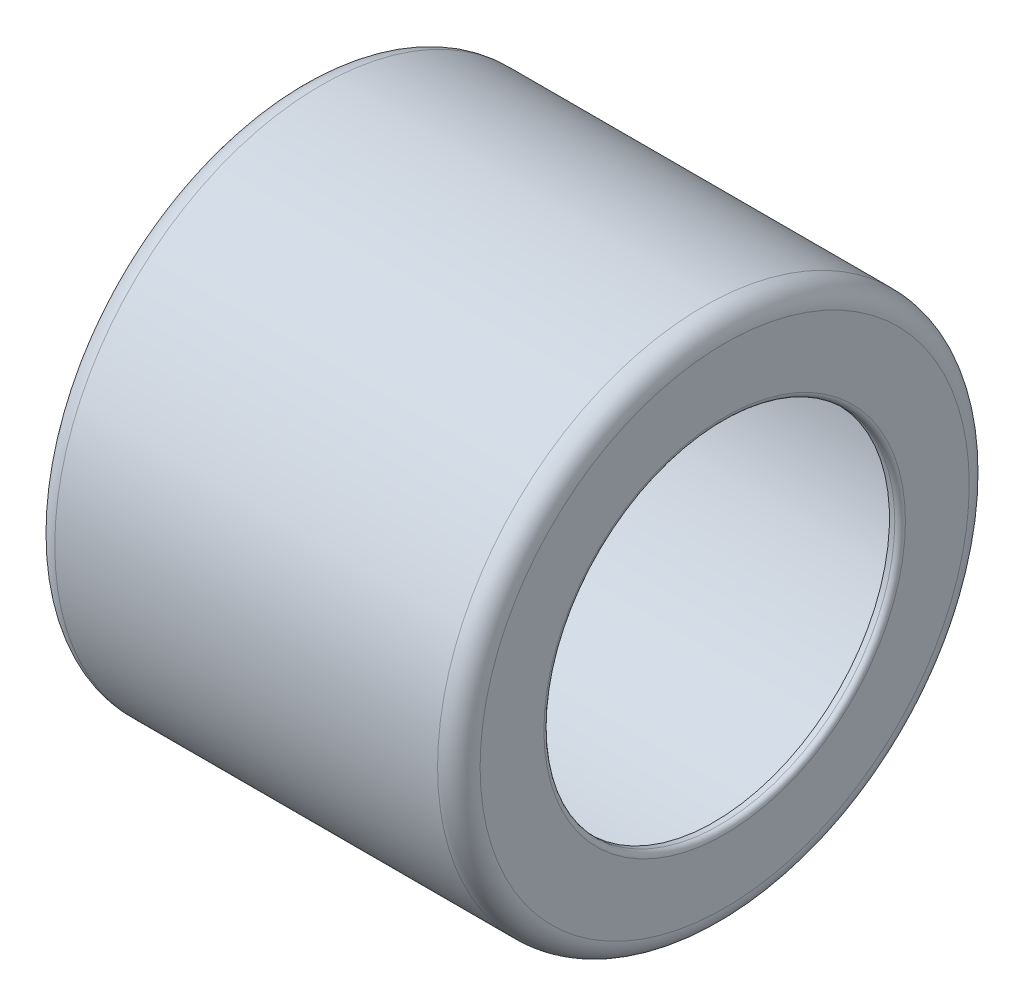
ISO-10303-21;
HEADER;
FILE_DESCRIPTION(('STEP AP214'),'2;1');
FILE_NAME('part.step','',(''),(''),'','','');
FILE_SCHEMA(('AUTOMOTIVE_DESIGN { 1 0 10303 214 1 1 1 1 }'));
ENDSEC;
DATA;
#1=APPLICATION_CONTEXT('core data for automotive mechanical design processes');
#2=APPLICATION_PROTOCOL_DEFINITION('international standard','automotive_design',2000,#1);
#3=PRODUCT_CONTEXT('',#1,'mechanical');
#4=PRODUCT('Part','Part','',(#3));
#5=PRODUCT_RELATED_PRODUCT_CATEGORY('part','',(#4));
#6=PRODUCT_DEFINITION_FORMATION('','',#4);
#7=PRODUCT_DEFINITION_CONTEXT('part definition',#1,'design');
#8=PRODUCT_DEFINITION('design','',#6,#7);
#9=PRODUCT_DEFINITION_SHAPE('','',#8);
#10=(LENGTH_UNIT() NAMED_UNIT(*) SI_UNIT(.MILLI.,.METRE.));
#11=(NAMED_UNIT(*) PLANE_ANGLE_UNIT() SI_UNIT($,.RADIAN.));
#12=(NAMED_UNIT(*) SI_UNIT($,.STERADIAN.) SOLID_ANGLE_UNIT());
#13=UNCERTAINTY_MEASURE_WITH_UNIT(LENGTH_MEASURE(1.E-05),#10,'distance_accuracy_value','');
#14=(GEOMETRIC_REPRESENTATION_CONTEXT(3) GLOBAL_UNCERTAINTY_ASSIGNED_CONTEXT((#13)) GLOBAL_UNIT_ASSIGNED_CONTEXT((#10,
#11,#12)) REPRESENTATION_CONTEXT('',''));
#15=CARTESIAN_POINT('',(0.,0.,0.));
#16=DIRECTION('',(0.,0.,1.));
#17=DIRECTION('',(1.,0.,0.));
#18=AXIS2_PLACEMENT_3D('',#15,#16,#17);
#19=CARTESIAN_POINT('',(3.80000000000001,5.,0.));
#20=DIRECTION('',(1.,0.,0.));
#21=DIRECTION('',(0.,0.,-1.));
#22=AXIS2_PLACEMENT_3D('',#19,#20,#21);
#23=PLANE('',#22);
#24=CARTESIAN_POINT('',(3.80000000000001,0.,0.));
#25=DIRECTION('',(-1.,0.,0.));
#26=DIRECTION('',(0.,0.,1.));
#27=AXIS2_PLACEMENT_3D('',#24,#25,#26);
#28=CIRCLE('',#27,3.3);
#29=CARTESIAN_POINT('',(3.80000000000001,0.,3.3));
#30=VERTEX_POINT('',#29);
#31=EDGE_CURVE('E391',#30,#30,#28,.T.);
#32=ORIENTED_EDGE('',*,*,#31,.F.);
#33=EDGE_LOOP('',(#32));
#34=FACE_BOUND('',#33,.T.);
#35=CARTESIAN_POINT('',(3.8,0.,0.));
#36=DIRECTION('',(-1.,0.,0.));
#37=DIRECTION('',(0.,0.,1.));
#38=AXIS2_PLACEMENT_3D('',#35,#36,#37);
#39=CIRCLE('',#38,4.8);
#40=CARTESIAN_POINT('',(3.8,0.,4.8));
#41=VERTEX_POINT('',#40);
#42=EDGE_CURVE('E400',#41,#41,#39,.T.);
#43=ORIENTED_EDGE('',*,*,#42,.T.);
#44=EDGE_LOOP('',(#43));
#45=FACE_BOUND('',#44,.T.);
#46=ADVANCED_FACE('F360',(#34,#45),#23,.F.);
#47=CARTESIAN_POINT('',(-51.6204134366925,0.,0.));
#48=DIRECTION('',(-1.,0.,0.));
#49=DIRECTION('',(0.,0.,1.));
#50=AXIS2_PLACEMENT_3D('',#47,#48,#49);
#51=CYLINDRICAL_SURFACE('',#50,3.3);
#52=CARTESIAN_POINT('',(3.90000000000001,0.,0.));
#53=DIRECTION('',(1.,0.,0.));
#54=DIRECTION('',(0.,0.,-1.));
#55=AXIS2_PLACEMENT_3D('',#52,#53,#54);
#56=CIRCLE('',#55,3.3);
#57=CARTESIAN_POINT('',(3.90000000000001,0.,-3.3));
#58=VERTEX_POINT('',#57);
#59=EDGE_CURVE('E385',#58,#58,#56,.T.);
#60=ORIENTED_EDGE('',*,*,#59,.T.);
#61=EDGE_LOOP('',(#60));
#62=FACE_BOUND('',#61,.T.);
#63=ORIENTED_EDGE('',*,*,#31,.T.);
#64=EDGE_LOOP('',(#63));
#65=FACE_BOUND('',#64,.T.);
#66=ADVANCED_FACE('F431',(#62,#65),#51,.F.);
#67=CARTESIAN_POINT('',(4.00000000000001,5.,0.));
#68=DIRECTION('',(1.,0.,0.));
#69=DIRECTION('',(0.,0.,-1.));
#70=AXIS2_PLACEMENT_3D('',#67,#68,#69);
#71=PLANE('',#70);
#72=CARTESIAN_POINT('',(4.00000000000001,0.,0.));
#73=DIRECTION('',(1.,0.,0.));
#74=DIRECTION('',(0.,0.,-1.));
#75=AXIS2_PLACEMENT_3D('',#72,#73,#74);
#76=CIRCLE('',#75,4.6);
#77=CARTESIAN_POINT('',(4.00000000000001,0.,-4.6));
#78=VERTEX_POINT('',#77);
#79=EDGE_CURVE('E366',#78,#78,#76,.T.);
#80=ORIENTED_EDGE('',*,*,#79,.T.);
#81=EDGE_LOOP('',(#80));
#82=FACE_BOUND('',#81,.T.);
#83=CARTESIAN_POINT('',(4.00000000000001,0.,0.));
#84=DIRECTION('',(1.,0.,0.));
#85=DIRECTION('',(0.,0.,-1.));
#86=AXIS2_PLACEMENT_3D('',#83,#84,#85);
#87=CIRCLE('',#86,3.4);
#88=CARTESIAN_POINT('',(4.00000000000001,0.,-3.4));
#89=VERTEX_POINT('',#88);
#90=EDGE_CURVE('E388',#89,#89,#87,.F.);
#91=ORIENTED_EDGE('',*,*,#90,.T.);
#92=EDGE_LOOP('',(#91));
#93=FACE_BOUND('',#92,.T.);
#94=ADVANCED_FACE('F435',(#82,#93),#71,.T.);
#95=CARTESIAN_POINT('',(-51.6204134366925,0.,0.));
#96=DIRECTION('',(-1.,0.,0.));
#97=DIRECTION('',(0.,0.,1.));
#98=AXIS2_PLACEMENT_3D('',#95,#96,#97);
#99=CYLINDRICAL_SURFACE('',#98,5.);
#100=CARTESIAN_POINT('',(3.60000000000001,0.,0.));
#101=DIRECTION('',(1.,0.,0.));
#102=DIRECTION('',(0.,0.,-1.));
#103=AXIS2_PLACEMENT_3D('',#100,#101,#102);
#104=CIRCLE('',#103,5.);
#105=CARTESIAN_POINT('',(3.60000000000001,0.,-5.));
#106=VERTEX_POINT('',#105);
#107=EDGE_CURVE('E370',#106,#106,#104,.F.);
#108=ORIENTED_EDGE('',*,*,#107,.T.);
#109=EDGE_LOOP('',(#108));
#110=FACE_BOUND('',#109,.T.);
#111=CARTESIAN_POINT('',(-3.59999999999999,0.,0.));
#112=DIRECTION('',(-1.,0.,0.));
#113=DIRECTION('',(0.,0.,1.));
#114=AXIS2_PLACEMENT_3D('',#111,#112,#113);
#115=CIRCLE('',#114,5.);
#116=CARTESIAN_POINT('',(-3.59999999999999,0.,5.));
#117=VERTEX_POINT('',#116);
#118=EDGE_CURVE('E374',#117,#117,#115,.F.);
#119=ORIENTED_EDGE('',*,*,#118,.T.);
#120=EDGE_LOOP('',(#119));
#121=FACE_BOUND('',#120,.T.);
#122=ADVANCED_FACE('F428',(#110,#121),#99,.T.);
#123=CARTESIAN_POINT('',(-4.,5.,0.));
#124=DIRECTION('',(-1.,0.,0.));
#125=DIRECTION('',(0.,0.,1.));
#126=AXIS2_PLACEMENT_3D('',#123,#124,#125);
#127=PLANE('',#126);
#128=CARTESIAN_POINT('',(-4.,0.,0.));
#129=DIRECTION('',(-1.,0.,0.));
#130=DIRECTION('',(0.,0.,1.));
#131=AXIS2_PLACEMENT_3D('',#128,#129,#130);
#132=CIRCLE('',#131,4.6);
#133=CARTESIAN_POINT('',(-4.,0.,4.6));
#134=VERTEX_POINT('',#133);
#135=EDGE_CURVE('E10',#134,#134,#132,.T.);
#136=ORIENTED_EDGE('',*,*,#135,.T.);
#137=EDGE_LOOP('',(#136));
#138=FACE_BOUND('',#137,.T.);
#139=CARTESIAN_POINT('',(-4.,0.,0.));
#140=DIRECTION('',(-1.,0.,0.));
#141=DIRECTION('',(0.,0.,1.));
#142=AXIS2_PLACEMENT_3D('',#139,#140,#141);
#143=CIRCLE('',#142,3.4);
#144=CARTESIAN_POINT('',(-4.,0.,3.4));
#145=VERTEX_POINT('',#144);
#146=EDGE_CURVE('E379',#145,#145,#143,.F.);
#147=ORIENTED_EDGE('',*,*,#146,.T.);
#148=EDGE_LOOP('',(#147));
#149=FACE_BOUND('',#148,.T.);
#150=ADVANCED_FACE('F420',(#138,#149),#127,.T.);
#151=CARTESIAN_POINT('',(-51.6204134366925,0.,0.));
#152=DIRECTION('',(-1.,0.,0.));
#153=DIRECTION('',(0.,0.,1.));
#154=AXIS2_PLACEMENT_3D('',#151,#152,#153);
#155=CYLINDRICAL_SURFACE('',#154,3.3);
#156=CARTESIAN_POINT('',(-3.89999999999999,0.,0.));
#157=DIRECTION('',(-1.,0.,0.));
#158=DIRECTION('',(0.,0.,1.));
#159=AXIS2_PLACEMENT_3D('',#156,#157,#158);
#160=CIRCLE('',#159,3.3);
#161=CARTESIAN_POINT('',(-3.89999999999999,0.,3.3));
#162=VERTEX_POINT('',#161);
#163=EDGE_CURVE('E382',#162,#162,#160,.T.);
#164=ORIENTED_EDGE('',*,*,#163,.T.);
#165=EDGE_LOOP('',(#164));
#166=FACE_BOUND('',#165,.T.);
#167=CARTESIAN_POINT('',(-3.8,0.,0.));
#168=DIRECTION('',(-1.,0.,0.));
#169=DIRECTION('',(0.,0.,1.));
#170=AXIS2_PLACEMENT_3D('',#167,#168,#169);
#171=CIRCLE('',#170,3.3);
#172=CARTESIAN_POINT('',(-3.8,0.,3.3));
#173=VERTEX_POINT('',#172);
#174=EDGE_CURVE('E394',#173,#173,#171,.T.);
#175=ORIENTED_EDGE('',*,*,#174,.F.);
#176=EDGE_LOOP('',(#175));
#177=FACE_BOUND('',#176,.T.);
#178=ADVANCED_FACE('F415',(#166,#177),#155,.F.);
#179=CARTESIAN_POINT('',(-3.8,5.,0.));
#180=DIRECTION('',(-1.,0.,0.));
#181=DIRECTION('',(0.,0.,1.));
#182=AXIS2_PLACEMENT_3D('',#179,#180,#181);
#183=PLANE('',#182);
#184=CARTESIAN_POINT('',(-3.8,0.,0.));
#185=DIRECTION('',(-1.,0.,0.));
#186=DIRECTION('',(0.,0.,1.));
#187=AXIS2_PLACEMENT_3D('',#184,#185,#186);
#188=CIRCLE('',#187,4.8);
#189=CARTESIAN_POINT('',(-3.8,0.,4.8));
#190=VERTEX_POINT('',#189);
#191=EDGE_CURVE('E397',#190,#190,#188,.T.);
#192=ORIENTED_EDGE('',*,*,#191,.F.);
#193=EDGE_LOOP('',(#192));
#194=FACE_BOUND('',#193,.T.);
#195=ORIENTED_EDGE('',*,*,#174,.T.);
#196=EDGE_LOOP('',(#195));
#197=FACE_BOUND('',#196,.T.);
#198=ADVANCED_FACE('F409',(#194,#197),#183,.F.);
#199=CARTESIAN_POINT('',(-51.6204134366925,0.,0.));
#200=DIRECTION('',(-1.,0.,0.));
#201=DIRECTION('',(0.,0.,1.));
#202=AXIS2_PLACEMENT_3D('',#199,#200,#201);
#203=CYLINDRICAL_SURFACE('',#202,4.8);
#204=ORIENTED_EDGE('',*,*,#42,.F.);
#205=EDGE_LOOP('',(#204));
#206=FACE_BOUND('',#205,.T.);
#207=ORIENTED_EDGE('',*,*,#191,.T.);
#208=EDGE_LOOP('',(#207));
#209=FACE_BOUND('',#208,.T.);
#210=ADVANCED_FACE('F405',(#206,#209),#203,.F.);
#211=CARTESIAN_POINT('',(3.90000000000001,0.,0.));
#212=DIRECTION('',(1.,0.,0.));
#213=DIRECTION('',(0.,0.,-1.));
#214=AXIS2_PLACEMENT_3D('',#211,#212,#213);
#215=TOROIDAL_SURFACE('',#214,3.4,0.1);
#216=ORIENTED_EDGE('',*,*,#59,.F.);
#217=EDGE_LOOP('',(#216));
#218=FACE_BOUND('',#217,.T.);
#219=ORIENTED_EDGE('',*,*,#90,.F.);
#220=EDGE_LOOP('',(#219));
#221=FACE_BOUND('',#220,.T.);
#222=ADVANCED_FACE('F408',(#218,#221),#215,.T.);
#223=CARTESIAN_POINT('',(-3.89999999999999,0.,0.));
#224=DIRECTION('',(-1.,0.,0.));
#225=DIRECTION('',(0.,0.,1.));
#226=AXIS2_PLACEMENT_3D('',#223,#224,#225);
#227=TOROIDAL_SURFACE('',#226,3.4,0.1);
#228=ORIENTED_EDGE('',*,*,#146,.F.);
#229=EDGE_LOOP('',(#228));
#230=FACE_BOUND('',#229,.T.);
#231=ORIENTED_EDGE('',*,*,#163,.F.);
#232=EDGE_LOOP('',(#231));
#233=FACE_BOUND('',#232,.T.);
#234=ADVANCED_FACE('F460',(#230,#233),#227,.T.);
#235=CARTESIAN_POINT('',(3.60000000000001,0.,0.));
#236=DIRECTION('',(1.,0.,0.));
#237=DIRECTION('',(0.,0.,-1.));
#238=AXIS2_PLACEMENT_3D('',#235,#236,#237);
#239=TOROIDAL_SURFACE('',#238,4.6,0.4);
#240=ORIENTED_EDGE('',*,*,#79,.F.);
#241=EDGE_LOOP('',(#240));
#242=FACE_BOUND('',#241,.T.);
#243=ORIENTED_EDGE('',*,*,#107,.F.);
#244=EDGE_LOOP('',(#243));
#245=FACE_BOUND('',#244,.T.);
#246=ADVANCED_FACE('F455',(#242,#245),#239,.T.);
#247=CARTESIAN_POINT('',(-3.59999999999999,0.,0.));
#248=DIRECTION('',(-1.,0.,0.));
#249=DIRECTION('',(0.,0.,1.));
#250=AXIS2_PLACEMENT_3D('',#247,#248,#249);
#251=TOROIDAL_SURFACE('',#250,4.6,0.4);
#252=ORIENTED_EDGE('',*,*,#118,.F.);
#253=EDGE_LOOP('',(#252));
#254=FACE_BOUND('',#253,.T.);
#255=ORIENTED_EDGE('',*,*,#135,.F.);
#256=EDGE_LOOP('',(#255));
#257=FACE_BOUND('',#256,.T.);
#258=ADVANCED_FACE('F452',(#254,#257),#251,.T.);
#259=CLOSED_SHELL('',(#46,#66,#94,#122,#150,#178,#198,#210,#222,#234,#246,#258));
#260=MANIFOLD_SOLID_BREP('B2',#259);
#261=ADVANCED_BREP_SHAPE_REPRESENTATION('',(#18,#260),#14);
#262=SHAPE_DEFINITION_REPRESENTATION(#9,#261);
ENDSEC;
END-ISO-10303-21;
